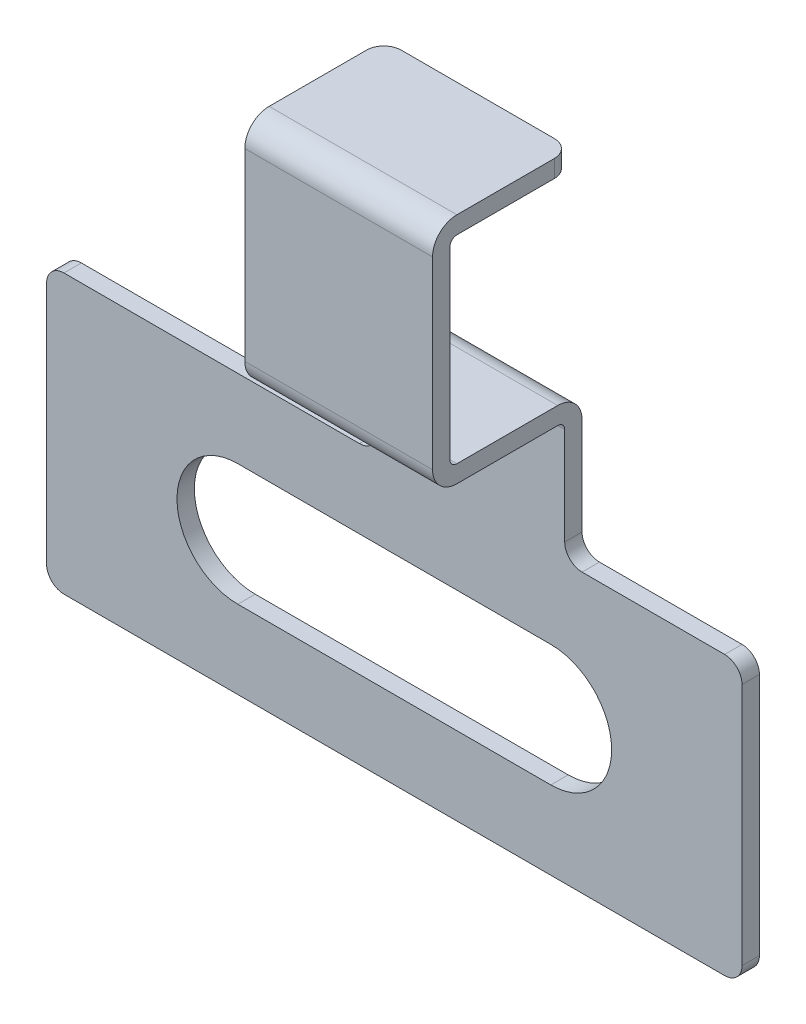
ISO-10303-21;
HEADER;
FILE_DESCRIPTION(('STEP AP214'),'2;1');
FILE_NAME('part.step','',(''),(''),'','','');
FILE_SCHEMA(('AUTOMOTIVE_DESIGN { 1 0 10303 214 1 1 1 1 }'));
ENDSEC;
DATA;
#1=APPLICATION_CONTEXT('core data for automotive mechanical design processes');
#2=APPLICATION_PROTOCOL_DEFINITION('international standard','automotive_design',2000,#1);
#3=PRODUCT_CONTEXT('',#1,'mechanical');
#4=PRODUCT('Part','Part','',(#3));
#5=PRODUCT_RELATED_PRODUCT_CATEGORY('part','',(#4));
#6=PRODUCT_DEFINITION_FORMATION('','',#4);
#7=PRODUCT_DEFINITION_CONTEXT('part definition',#1,'design');
#8=PRODUCT_DEFINITION('design','',#6,#7);
#9=PRODUCT_DEFINITION_SHAPE('','',#8);
#10=(LENGTH_UNIT() NAMED_UNIT(*) SI_UNIT(.MILLI.,.METRE.));
#11=(NAMED_UNIT(*) PLANE_ANGLE_UNIT() SI_UNIT($,.RADIAN.));
#12=(NAMED_UNIT(*) SI_UNIT($,.STERADIAN.) SOLID_ANGLE_UNIT());
#13=UNCERTAINTY_MEASURE_WITH_UNIT(LENGTH_MEASURE(1.E-05),#10,'distance_accuracy_value','');
#14=(GEOMETRIC_REPRESENTATION_CONTEXT(3) GLOBAL_UNCERTAINTY_ASSIGNED_CONTEXT((#13)) GLOBAL_UNIT_ASSIGNED_CONTEXT((#10,
#11,#12)) REPRESENTATION_CONTEXT('',''));
#15=CARTESIAN_POINT('',(0.,0.,0.));
#16=DIRECTION('',(0.,0.,1.));
#17=DIRECTION('',(1.,0.,0.));
#18=AXIS2_PLACEMENT_3D('',#15,#16,#17);
#19=CARTESIAN_POINT('',(-5.5,13.7,3.6));
#20=DIRECTION('',(0.,-1.,0.));
#21=DIRECTION('',(-1.,0.,0.));
#22=AXIS2_PLACEMENT_3D('',#19,#20,#21);
#23=PLANE('',#22);
#24=DIRECTION('',(1.,0.,0.));
#25=VECTOR('',#24,1.);
#26=CARTESIAN_POINT('',(-5.5,13.7,0.3));
#27=LINE('',#26,#25);
#28=CARTESIAN_POINT('',(4.5,13.7,0.3));
#29=VERTEX_POINT('',#28);
#30=CARTESIAN_POINT('',(8.9,13.7,0.3));
#31=VERTEX_POINT('',#30);
#32=EDGE_CURVE('E393',#29,#31,#27,.T.);
#33=ORIENTED_EDGE('',*,*,#32,.T.);
#34=CARTESIAN_POINT('',(8.9,13.7,0.8));
#35=DIRECTION('',(0.,-1.,0.));
#36=DIRECTION('',(-1.,0.,0.));
#37=AXIS2_PLACEMENT_3D('',#34,#35,#36);
#38=CIRCLE('',#37,0.5);
#39=CARTESIAN_POINT('',(9.4,13.7,0.8));
#40=VERTEX_POINT('',#39);
#41=EDGE_CURVE('E518',#31,#40,#38,.T.);
#42=ORIENTED_EDGE('',*,*,#41,.T.);
#43=DIRECTION('',(0.,0.,-1.));
#44=VECTOR('',#43,1.);
#45=CARTESIAN_POINT('',(9.4,13.7,3.6));
#46=LINE('',#45,#44);
#47=CARTESIAN_POINT('',(9.4,13.7,3.6));
#48=VERTEX_POINT('',#47);
#49=EDGE_CURVE('E289',#48,#40,#46,.T.);
#50=ORIENTED_EDGE('',*,*,#49,.F.);
#51=DIRECTION('',(1.,0.,0.));
#52=VECTOR('',#51,1.);
#53=CARTESIAN_POINT('',(-5.5,13.7,3.6));
#54=LINE('',#53,#52);
#55=CARTESIAN_POINT('',(4.,13.7,3.6));
#56=VERTEX_POINT('',#55);
#57=EDGE_CURVE('E400',#56,#48,#54,.T.);
#58=ORIENTED_EDGE('',*,*,#57,.F.);
#59=DIRECTION('',(0.,0.,1.));
#60=VECTOR('',#59,1.);
#61=CARTESIAN_POINT('',(4.,13.7,3.6));
#62=LINE('',#61,#60);
#63=CARTESIAN_POINT('',(4.,13.7,0.8));
#64=VERTEX_POINT('',#63);
#65=EDGE_CURVE('E344',#64,#56,#62,.T.);
#66=ORIENTED_EDGE('',*,*,#65,.F.);
#67=CARTESIAN_POINT('',(4.5,13.7,0.8));
#68=DIRECTION('',(0.,-1.,0.));
#69=DIRECTION('',(-1.,0.,0.));
#70=AXIS2_PLACEMENT_3D('',#67,#68,#69);
#71=CIRCLE('',#70,0.5);
#72=EDGE_CURVE('E515',#64,#29,#71,.T.);
#73=ORIENTED_EDGE('',*,*,#72,.T.);
#74=EDGE_LOOP('',(#33,#42,#50,#58,#66,#73));
#75=FACE_BOUND('',#74,.T.);
#76=ADVANCED_FACE('F15',(#75),#23,.T.);
#77=CARTESIAN_POINT('',(-5.5,13.5,3.6));
#78=DIRECTION('',(1.,0.,0.));
#79=DIRECTION('',(0.,0.,-1.));
#80=AXIS2_PLACEMENT_3D('',#77,#78,#79);
#81=CYLINDRICAL_SURFACE('',#80,0.2);
#82=CARTESIAN_POINT('',(9.4,13.5,3.6));
#83=DIRECTION('',(-1.,0.,0.));
#84=DIRECTION('',(0.,1.,0.));
#85=AXIS2_PLACEMENT_3D('',#82,#83,#84);
#86=CIRCLE('',#85,0.2);
#87=CARTESIAN_POINT('',(9.4,13.5,3.8));
#88=VERTEX_POINT('',#87);
#89=EDGE_CURVE('E293',#88,#48,#86,.T.);
#90=ORIENTED_EDGE('',*,*,#89,.F.);
#91=DIRECTION('',(1.,0.,0.));
#92=VECTOR('',#91,1.);
#93=CARTESIAN_POINT('',(-5.5,13.5,3.8));
#94=LINE('',#93,#92);
#95=CARTESIAN_POINT('',(4.,13.5,3.8));
#96=VERTEX_POINT('',#95);
#97=EDGE_CURVE('E405',#96,#88,#94,.T.);
#98=ORIENTED_EDGE('',*,*,#97,.F.);
#99=CARTESIAN_POINT('',(4.,13.5,3.6));
#100=DIRECTION('',(1.,0.,0.));
#101=DIRECTION('',(0.,-1.,0.));
#102=AXIS2_PLACEMENT_3D('',#99,#100,#101);
#103=CIRCLE('',#102,0.2);
#104=EDGE_CURVE('E347',#56,#96,#103,.T.);
#105=ORIENTED_EDGE('',*,*,#104,.F.);
#106=ORIENTED_EDGE('',*,*,#57,.T.);
#107=EDGE_LOOP('',(#90,#98,#105,#106));
#108=FACE_BOUND('',#107,.T.);
#109=ADVANCED_FACE('F638',(#108),#81,.F.);
#110=CARTESIAN_POINT('',(-5.5,8.2,3.8));
#111=DIRECTION('',(0.,0.,-1.));
#112=DIRECTION('',(-1.,0.,0.));
#113=AXIS2_PLACEMENT_3D('',#110,#111,#112);
#114=PLANE('',#113);
#115=DIRECTION('',(0.,1.,0.));
#116=VECTOR('',#115,1.);
#117=CARTESIAN_POINT('',(9.4,8.2,3.8));
#118=LINE('',#117,#116);
#119=CARTESIAN_POINT('',(9.4,8.2,3.8));
#120=VERTEX_POINT('',#119);
#121=EDGE_CURVE('E296',#120,#88,#118,.T.);
#122=ORIENTED_EDGE('',*,*,#121,.F.);
#123=DIRECTION('',(1.,0.,0.));
#124=VECTOR('',#123,1.);
#125=CARTESIAN_POINT('',(-5.5,8.2,3.8));
#126=LINE('',#125,#124);
#127=CARTESIAN_POINT('',(4.,8.2,3.8));
#128=VERTEX_POINT('',#127);
#129=EDGE_CURVE('E409',#128,#120,#126,.T.);
#130=ORIENTED_EDGE('',*,*,#129,.F.);
#131=DIRECTION('',(0.,-1.,0.));
#132=VECTOR('',#131,1.);
#133=CARTESIAN_POINT('',(4.,8.2,3.8));
#134=LINE('',#133,#132);
#135=EDGE_CURVE('E350',#96,#128,#134,.T.);
#136=ORIENTED_EDGE('',*,*,#135,.F.);
#137=ORIENTED_EDGE('',*,*,#97,.T.);
#138=EDGE_LOOP('',(#122,#130,#136,#137));
#139=FACE_BOUND('',#138,.T.);
#140=ADVANCED_FACE('F645',(#139),#114,.T.);
#141=CARTESIAN_POINT('',(-5.5,8.2,3.6));
#142=DIRECTION('',(1.,0.,0.));
#143=DIRECTION('',(0.,0.,-1.));
#144=AXIS2_PLACEMENT_3D('',#141,#142,#143);
#145=CYLINDRICAL_SURFACE('',#144,0.2);
#146=CARTESIAN_POINT('',(9.4,8.2,3.6));
#147=DIRECTION('',(-1.,0.,0.));
#148=DIRECTION('',(0.,1.,0.));
#149=AXIS2_PLACEMENT_3D('',#146,#147,#148);
#150=CIRCLE('',#149,0.2);
#151=CARTESIAN_POINT('',(9.4,8.,3.6));
#152=VERTEX_POINT('',#151);
#153=EDGE_CURVE('E299',#152,#120,#150,.T.);
#154=ORIENTED_EDGE('',*,*,#153,.F.);
#155=DIRECTION('',(1.,0.,0.));
#156=VECTOR('',#155,1.);
#157=CARTESIAN_POINT('',(-5.5,8.,3.6));
#158=LINE('',#157,#156);
#159=CARTESIAN_POINT('',(4.,8.,3.6));
#160=VERTEX_POINT('',#159);
#161=EDGE_CURVE('E413',#160,#152,#158,.T.);
#162=ORIENTED_EDGE('',*,*,#161,.F.);
#163=CARTESIAN_POINT('',(4.,8.2,3.6));
#164=DIRECTION('',(1.,0.,0.));
#165=DIRECTION('',(0.,-1.,0.));
#166=AXIS2_PLACEMENT_3D('',#163,#164,#165);
#167=CIRCLE('',#166,0.2);
#168=EDGE_CURVE('E353',#128,#160,#167,.T.);
#169=ORIENTED_EDGE('',*,*,#168,.F.);
#170=ORIENTED_EDGE('',*,*,#129,.T.);
#171=EDGE_LOOP('',(#154,#162,#169,#170));
#172=FACE_BOUND('',#171,.T.);
#173=ADVANCED_FACE('F854',(#172),#145,.F.);
#174=CARTESIAN_POINT('',(-5.5,8.,0.7));
#175=DIRECTION('',(0.,1.,0.));
#176=DIRECTION('',(0.,0.,1.));
#177=AXIS2_PLACEMENT_3D('',#174,#175,#176);
#178=PLANE('',#177);
#179=DIRECTION('',(0.,0.,1.));
#180=VECTOR('',#179,1.);
#181=CARTESIAN_POINT('',(9.4,8.,0.7));
#182=LINE('',#181,#180);
#183=CARTESIAN_POINT('',(9.4,8.,0.7));
#184=VERTEX_POINT('',#183);
#185=EDGE_CURVE('E302',#184,#152,#182,.T.);
#186=ORIENTED_EDGE('',*,*,#185,.F.);
#187=DIRECTION('',(1.,0.,0.));
#188=VECTOR('',#187,1.);
#189=CARTESIAN_POINT('',(-5.5,8.,0.7));
#190=LINE('',#189,#188);
#191=CARTESIAN_POINT('',(4.,8.,0.7));
#192=VERTEX_POINT('',#191);
#193=EDGE_CURVE('E417',#192,#184,#190,.T.);
#194=ORIENTED_EDGE('',*,*,#193,.F.);
#195=DIRECTION('',(0.,0.,-1.));
#196=VECTOR('',#195,1.);
#197=CARTESIAN_POINT('',(4.,8.,0.7));
#198=LINE('',#197,#196);
#199=EDGE_CURVE('E356',#160,#192,#198,.T.);
#200=ORIENTED_EDGE('',*,*,#199,.F.);
#201=ORIENTED_EDGE('',*,*,#161,.T.);
#202=EDGE_LOOP('',(#186,#194,#200,#201));
#203=FACE_BOUND('',#202,.T.);
#204=ADVANCED_FACE('F846',(#203),#178,.T.);
#205=CARTESIAN_POINT('',(-5.5,7.3,0.7));
#206=DIRECTION('',(1.,0.,0.));
#207=DIRECTION('',(0.,0.,-1.));
#208=AXIS2_PLACEMENT_3D('',#205,#206,#207);
#209=CYLINDRICAL_SURFACE('',#208,0.7);
#210=CARTESIAN_POINT('',(9.4,7.3,0.7));
#211=DIRECTION('',(-1.,0.,0.));
#212=DIRECTION('',(0.,1.,0.));
#213=AXIS2_PLACEMENT_3D('',#210,#211,#212);
#214=CIRCLE('',#213,0.7);
#215=CARTESIAN_POINT('',(9.4,7.3,0.));
#216=VERTEX_POINT('',#215);
#217=EDGE_CURVE('E305',#216,#184,#214,.F.);
#218=ORIENTED_EDGE('',*,*,#217,.F.);
#219=DIRECTION('',(1.,0.,0.));
#220=VECTOR('',#219,1.);
#221=CARTESIAN_POINT('',(-5.5,7.3,0.));
#222=LINE('',#221,#220);
#223=CARTESIAN_POINT('',(4.,7.3,0.));
#224=VERTEX_POINT('',#223);
#225=EDGE_CURVE('E421',#224,#216,#222,.T.);
#226=ORIENTED_EDGE('',*,*,#225,.F.);
#227=CARTESIAN_POINT('',(4.,7.3,0.7));
#228=DIRECTION('',(1.,0.,0.));
#229=DIRECTION('',(0.,-1.,0.));
#230=AXIS2_PLACEMENT_3D('',#227,#228,#229);
#231=CIRCLE('',#230,0.7);
#232=EDGE_CURVE('E359',#192,#224,#231,.F.);
#233=ORIENTED_EDGE('',*,*,#232,.F.);
#234=ORIENTED_EDGE('',*,*,#193,.T.);
#235=EDGE_LOOP('',(#218,#226,#233,#234));
#236=FACE_BOUND('',#235,.T.);
#237=ADVANCED_FACE('F583',(#236),#209,.T.);
#238=CARTESIAN_POINT('',(-5.5,7.3,0.));
#239=DIRECTION('',(0.,0.,-1.));
#240=DIRECTION('',(0.,1.,0.));
#241=AXIS2_PLACEMENT_3D('',#238,#239,#240);
#242=PLANE('',#241);
#243=CARTESIAN_POINT('',(0.,0.,0.));
#244=DIRECTION('',(0.,0.,-1.));
#245=DIRECTION('',(0.,1.,0.));
#246=AXIS2_PLACEMENT_3D('',#243,#244,#245);
#247=CIRCLE('',#246,1.75);
#248=CARTESIAN_POINT('',(0.,-1.75,0.));
#249=VERTEX_POINT('',#248);
#250=CARTESIAN_POINT('',(0.,1.75,0.));
#251=VERTEX_POINT('',#250);
#252=EDGE_CURVE('E268',#249,#251,#247,.T.);
#253=ORIENTED_EDGE('',*,*,#252,.F.);
#254=DIRECTION('',(-1.,0.,0.));
#255=VECTOR('',#254,1.);
#256=CARTESIAN_POINT('',(-5.5,-1.75,0.));
#257=LINE('',#256,#255);
#258=CARTESIAN_POINT('',(9.,-1.75,0.));
#259=VERTEX_POINT('',#258);
#260=EDGE_CURVE('E256',#259,#249,#257,.T.);
#261=ORIENTED_EDGE('',*,*,#260,.F.);
#262=CARTESIAN_POINT('',(9.,0.,0.));
#263=DIRECTION('',(0.,0.,-1.));
#264=DIRECTION('',(0.,1.,0.));
#265=AXIS2_PLACEMENT_3D('',#262,#263,#264);
#266=CIRCLE('',#265,1.75);
#267=CARTESIAN_POINT('',(9.,1.75,0.));
#268=VERTEX_POINT('',#267);
#269=EDGE_CURVE('E230',#268,#259,#266,.T.);
#270=ORIENTED_EDGE('',*,*,#269,.F.);
#271=DIRECTION('',(1.,0.,0.));
#272=VECTOR('',#271,1.);
#273=CARTESIAN_POINT('',(-5.5,1.75,0.));
#274=LINE('',#273,#272);
#275=EDGE_CURVE('E265',#251,#268,#274,.T.);
#276=ORIENTED_EDGE('',*,*,#275,.F.);
#277=EDGE_LOOP('',(#253,#261,#270,#276));
#278=FACE_BOUND('',#277,.T.);
#279=DIRECTION('',(1.,0.,0.));
#280=VECTOR('',#279,1.);
#281=CARTESIAN_POINT('',(14.5,4.,0.));
#282=LINE('',#281,#280);
#283=CARTESIAN_POINT('',(9.9,4.,0.));
#284=VERTEX_POINT('',#283);
#285=CARTESIAN_POINT('',(14.,4.,0.));
#286=VERTEX_POINT('',#285);
#287=EDGE_CURVE('E276',#284,#286,#282,.T.);
#288=ORIENTED_EDGE('',*,*,#287,.T.);
#289=CARTESIAN_POINT('',(14.,3.5,0.));
#290=DIRECTION('',(0.,0.,-1.));
#291=DIRECTION('',(0.,1.,0.));
#292=AXIS2_PLACEMENT_3D('',#289,#290,#291);
#293=CIRCLE('',#292,0.5);
#294=CARTESIAN_POINT('',(14.5,3.5,0.));
#295=VERTEX_POINT('',#294);
#296=EDGE_CURVE('E498',#286,#295,#293,.T.);
#297=ORIENTED_EDGE('',*,*,#296,.T.);
#298=DIRECTION('',(0.,1.,0.));
#299=VECTOR('',#298,1.);
#300=CARTESIAN_POINT('',(14.5,7.3,0.));
#301=LINE('',#300,#299);
#302=CARTESIAN_POINT('',(14.5,-3.5,0.));
#303=VERTEX_POINT('',#302);
#304=EDGE_CURVE('E389',#303,#295,#301,.T.);
#305=ORIENTED_EDGE('',*,*,#304,.F.);
#306=CARTESIAN_POINT('',(14.,-3.5,0.));
#307=DIRECTION('',(0.,0.,-1.));
#308=DIRECTION('',(0.,1.,0.));
#309=AXIS2_PLACEMENT_3D('',#306,#307,#308);
#310=CIRCLE('',#309,0.5);
#311=CARTESIAN_POINT('',(14.,-4.,0.));
#312=VERTEX_POINT('',#311);
#313=EDGE_CURVE('E495',#303,#312,#310,.T.);
#314=ORIENTED_EDGE('',*,*,#313,.T.);
#315=DIRECTION('',(1.,0.,0.));
#316=VECTOR('',#315,1.);
#317=CARTESIAN_POINT('',(-5.5,-4.,0.));
#318=LINE('',#317,#316);
#319=CARTESIAN_POINT('',(-5.,-4.,0.));
#320=VERTEX_POINT('',#319);
#321=EDGE_CURVE('E425',#320,#312,#318,.T.);
#322=ORIENTED_EDGE('',*,*,#321,.F.);
#323=CARTESIAN_POINT('',(-5.,-3.5,0.));
#324=DIRECTION('',(0.,0.,-1.));
#325=DIRECTION('',(0.,1.,0.));
#326=AXIS2_PLACEMENT_3D('',#323,#324,#325);
#327=CIRCLE('',#326,0.5);
#328=CARTESIAN_POINT('',(-5.5,-3.5,0.));
#329=VERTEX_POINT('',#328);
#330=EDGE_CURVE('E492',#320,#329,#327,.T.);
#331=ORIENTED_EDGE('',*,*,#330,.T.);
#332=DIRECTION('',(0.,1.,0.));
#333=VECTOR('',#332,1.);
#334=CARTESIAN_POINT('',(-5.5,7.3,0.));
#335=LINE('',#334,#333);
#336=CARTESIAN_POINT('',(-5.5,3.5,0.));
#337=VERTEX_POINT('',#336);
#338=EDGE_CURVE('E388',#329,#337,#335,.T.);
#339=ORIENTED_EDGE('',*,*,#338,.T.);
#340=CARTESIAN_POINT('',(-5.,3.5,0.));
#341=DIRECTION('',(0.,0.,-1.));
#342=DIRECTION('',(0.,1.,0.));
#343=AXIS2_PLACEMENT_3D('',#340,#341,#342);
#344=CIRCLE('',#343,0.5);
#345=CARTESIAN_POINT('',(-5.,4.,0.));
#346=VERTEX_POINT('',#345);
#347=EDGE_CURVE('E489',#337,#346,#344,.T.);
#348=ORIENTED_EDGE('',*,*,#347,.T.);
#349=DIRECTION('',(1.,0.,0.));
#350=VECTOR('',#349,1.);
#351=CARTESIAN_POINT('',(-5.5,4.,0.));
#352=LINE('',#351,#350);
#353=CARTESIAN_POINT('',(3.5,4.,0.));
#354=VERTEX_POINT('',#353);
#355=EDGE_CURVE('E328',#346,#354,#352,.T.);
#356=ORIENTED_EDGE('',*,*,#355,.T.);
#357=CARTESIAN_POINT('',(3.5,4.5,0.));
#358=DIRECTION('',(0.,0.,-1.));
#359=DIRECTION('',(0.,1.,0.));
#360=AXIS2_PLACEMENT_3D('',#357,#358,#359);
#361=CIRCLE('',#360,0.5);
#362=CARTESIAN_POINT('',(4.,4.5,0.));
#363=VERTEX_POINT('',#362);
#364=EDGE_CURVE('E9',#354,#363,#361,.F.);
#365=ORIENTED_EDGE('',*,*,#364,.T.);
#366=DIRECTION('',(0.,1.,0.));
#367=VECTOR('',#366,1.);
#368=CARTESIAN_POINT('',(4.,14.2,0.));
#369=LINE('',#368,#367);
#370=EDGE_CURVE('E332',#363,#224,#369,.T.);
#371=ORIENTED_EDGE('',*,*,#370,.T.);
#372=ORIENTED_EDGE('',*,*,#225,.T.);
#373=DIRECTION('',(0.,-1.,0.));
#374=VECTOR('',#373,1.);
#375=CARTESIAN_POINT('',(9.4,14.2,0.));
#376=LINE('',#375,#374);
#377=CARTESIAN_POINT('',(9.4,4.5,0.));
#378=VERTEX_POINT('',#377);
#379=EDGE_CURVE('E272',#216,#378,#376,.T.);
#380=ORIENTED_EDGE('',*,*,#379,.T.);
#381=CARTESIAN_POINT('',(9.9,4.5,0.));
#382=DIRECTION('',(0.,0.,-1.));
#383=DIRECTION('',(0.,1.,0.));
#384=AXIS2_PLACEMENT_3D('',#381,#382,#383);
#385=CIRCLE('',#384,0.5);
#386=EDGE_CURVE('E558',#378,#284,#385,.F.);
#387=ORIENTED_EDGE('',*,*,#386,.T.);
#388=EDGE_LOOP('',(#288,#297,#305,#314,#322,#331,#339,#348,#356,#365,#371,#372,#380,#387));
#389=FACE_BOUND('',#388,.T.);
#390=ADVANCED_FACE('F573',(#278,#389),#242,.T.);
#391=CARTESIAN_POINT('',(-5.5,-4.,0.));
#392=DIRECTION('',(0.,1.,0.));
#393=DIRECTION('',(1.,0.,0.));
#394=AXIS2_PLACEMENT_3D('',#391,#392,#393);
#395=PLANE('',#394);
#396=ORIENTED_EDGE('',*,*,#321,.T.);
#397=DIRECTION('',(0.,0.,1.));
#398=VECTOR('',#397,1.);
#399=CARTESIAN_POINT('',(14.,-4.,0.5));
#400=LINE('',#399,#398);
#401=CARTESIAN_POINT('',(14.,-4.,0.5));
#402=VERTEX_POINT('',#401);
#403=EDGE_CURVE('E530',#312,#402,#400,.T.);
#404=ORIENTED_EDGE('',*,*,#403,.T.);
#405=DIRECTION('',(1.,0.,0.));
#406=VECTOR('',#405,1.);
#407=CARTESIAN_POINT('',(-5.5,-4.,0.5));
#408=LINE('',#407,#406);
#409=CARTESIAN_POINT('',(-5.,-4.,0.5));
#410=VERTEX_POINT('',#409);
#411=EDGE_CURVE('E429',#410,#402,#408,.T.);
#412=ORIENTED_EDGE('',*,*,#411,.F.);
#413=DIRECTION('',(0.,0.,1.));
#414=VECTOR('',#413,1.);
#415=CARTESIAN_POINT('',(-5.,-4.,0.));
#416=LINE('',#415,#414);
#417=EDGE_CURVE('E527',#410,#320,#416,.F.);
#418=ORIENTED_EDGE('',*,*,#417,.T.);
#419=EDGE_LOOP('',(#396,#404,#412,#418));
#420=FACE_BOUND('',#419,.T.);
#421=ADVANCED_FACE('F612',(#420),#395,.F.);
#422=CARTESIAN_POINT('',(-5.5,7.3,0.5));
#423=DIRECTION('',(0.,0.,-1.));
#424=DIRECTION('',(0.,1.,0.));
#425=AXIS2_PLACEMENT_3D('',#422,#423,#424);
#426=PLANE('',#425);
#427=DIRECTION('',(1.,0.,0.));
#428=VECTOR('',#427,1.);
#429=CARTESIAN_POINT('',(0.,-1.75,0.5));
#430=LINE('',#429,#428);
#431=CARTESIAN_POINT('',(0.,-1.75,0.5));
#432=VERTEX_POINT('',#431);
#433=CARTESIAN_POINT('',(9.,-1.75,0.5));
#434=VERTEX_POINT('',#433);
#435=EDGE_CURVE('E237',#432,#434,#430,.T.);
#436=ORIENTED_EDGE('',*,*,#435,.F.);
#437=CARTESIAN_POINT('',(0.,0.,0.5));
#438=DIRECTION('',(0.,0.,1.));
#439=DIRECTION('',(0.,1.,0.));
#440=AXIS2_PLACEMENT_3D('',#437,#438,#439);
#441=CIRCLE('',#440,1.75);
#442=CARTESIAN_POINT('',(0.,1.75,0.5));
#443=VERTEX_POINT('',#442);
#444=EDGE_CURVE('E39',#443,#432,#441,.T.);
#445=ORIENTED_EDGE('',*,*,#444,.F.);
#446=DIRECTION('',(-1.,0.,0.));
#447=VECTOR('',#446,1.);
#448=CARTESIAN_POINT('',(0.,1.75,0.5));
#449=LINE('',#448,#447);
#450=CARTESIAN_POINT('',(9.,1.75,0.5));
#451=VERTEX_POINT('',#450);
#452=EDGE_CURVE('E245',#451,#443,#449,.T.);
#453=ORIENTED_EDGE('',*,*,#452,.F.);
#454=CARTESIAN_POINT('',(9.,0.,0.5));
#455=DIRECTION('',(0.,0.,1.));
#456=DIRECTION('',(0.,1.,0.));
#457=AXIS2_PLACEMENT_3D('',#454,#455,#456);
#458=CIRCLE('',#457,1.75);
#459=EDGE_CURVE('E227',#434,#451,#458,.T.);
#460=ORIENTED_EDGE('',*,*,#459,.F.);
#461=EDGE_LOOP('',(#436,#445,#453,#460));
#462=FACE_BOUND('',#461,.T.);
#463=DIRECTION('',(0.,1.,0.));
#464=VECTOR('',#463,1.);
#465=CARTESIAN_POINT('',(14.5,7.3,0.5));
#466=LINE('',#465,#464);
#467=CARTESIAN_POINT('',(14.5,-3.5,0.5));
#468=VERTEX_POINT('',#467);
#469=CARTESIAN_POINT('',(14.5,3.5,0.5));
#470=VERTEX_POINT('',#469);
#471=EDGE_CURVE('E383',#468,#470,#466,.T.);
#472=ORIENTED_EDGE('',*,*,#471,.T.);
#473=CARTESIAN_POINT('',(14.,3.5,0.5));
#474=DIRECTION('',(0.,0.,-1.));
#475=DIRECTION('',(0.,1.,0.));
#476=AXIS2_PLACEMENT_3D('',#473,#474,#475);
#477=CIRCLE('',#476,0.5);
#478=CARTESIAN_POINT('',(14.,4.,0.5));
#479=VERTEX_POINT('',#478);
#480=EDGE_CURVE('E479',#470,#479,#477,.F.);
#481=ORIENTED_EDGE('',*,*,#480,.T.);
#482=DIRECTION('',(-1.,0.,0.));
#483=VECTOR('',#482,1.);
#484=CARTESIAN_POINT('',(-5.5,4.,0.5));
#485=LINE('',#484,#483);
#486=CARTESIAN_POINT('',(9.9,4.,0.5));
#487=VERTEX_POINT('',#486);
#488=EDGE_CURVE('E285',#479,#487,#485,.T.);
#489=ORIENTED_EDGE('',*,*,#488,.T.);
#490=CARTESIAN_POINT('',(9.9,4.5,0.5));
#491=DIRECTION('',(0.,0.,-1.));
#492=DIRECTION('',(0.,1.,0.));
#493=AXIS2_PLACEMENT_3D('',#490,#491,#492);
#494=CIRCLE('',#493,0.5);
#495=CARTESIAN_POINT('',(9.4,4.5,0.5));
#496=VERTEX_POINT('',#495);
#497=EDGE_CURVE('E555',#487,#496,#494,.T.);
#498=ORIENTED_EDGE('',*,*,#497,.T.);
#499=DIRECTION('',(0.,1.,0.));
#500=VECTOR('',#499,1.);
#501=CARTESIAN_POINT('',(9.4,7.3,0.5));
#502=LINE('',#501,#500);
#503=CARTESIAN_POINT('',(9.4,7.3,0.5));
#504=VERTEX_POINT('',#503);
#505=EDGE_CURVE('E324',#496,#504,#502,.T.);
#506=ORIENTED_EDGE('',*,*,#505,.T.);
#507=DIRECTION('',(1.,0.,0.));
#508=VECTOR('',#507,1.);
#509=CARTESIAN_POINT('',(-5.5,7.3,0.5));
#510=LINE('',#509,#508);
#511=CARTESIAN_POINT('',(4.,7.3,0.5));
#512=VERTEX_POINT('',#511);
#513=EDGE_CURVE('E433',#512,#504,#510,.T.);
#514=ORIENTED_EDGE('',*,*,#513,.F.);
#515=DIRECTION('',(0.,-1.,0.));
#516=VECTOR('',#515,1.);
#517=CARTESIAN_POINT('',(4.,7.3,0.5));
#518=LINE('',#517,#516);
#519=CARTESIAN_POINT('',(4.,4.5,0.5));
#520=VERTEX_POINT('',#519);
#521=EDGE_CURVE('E379',#512,#520,#518,.T.);
#522=ORIENTED_EDGE('',*,*,#521,.T.);
#523=CARTESIAN_POINT('',(3.5,4.5,0.5));
#524=DIRECTION('',(0.,0.,-1.));
#525=DIRECTION('',(0.,1.,0.));
#526=AXIS2_PLACEMENT_3D('',#523,#524,#525);
#527=CIRCLE('',#526,0.5);
#528=CARTESIAN_POINT('',(3.5,4.,0.5));
#529=VERTEX_POINT('',#528);
#530=EDGE_CURVE('E24',#520,#529,#527,.T.);
#531=ORIENTED_EDGE('',*,*,#530,.T.);
#532=DIRECTION('',(-1.,0.,0.));
#533=VECTOR('',#532,1.);
#534=CARTESIAN_POINT('',(-5.5,4.,0.5));
#535=LINE('',#534,#533);
#536=CARTESIAN_POINT('',(-5.,4.,0.5));
#537=VERTEX_POINT('',#536);
#538=EDGE_CURVE('E340',#529,#537,#535,.T.);
#539=ORIENTED_EDGE('',*,*,#538,.T.);
#540=CARTESIAN_POINT('',(-5.,3.5,0.5));
#541=DIRECTION('',(0.,0.,-1.));
#542=DIRECTION('',(0.,1.,0.));
#543=AXIS2_PLACEMENT_3D('',#540,#541,#542);
#544=CIRCLE('',#543,0.5);
#545=CARTESIAN_POINT('',(-5.5,3.5,0.5));
#546=VERTEX_POINT('',#545);
#547=EDGE_CURVE('E470',#537,#546,#544,.F.);
#548=ORIENTED_EDGE('',*,*,#547,.T.);
#549=DIRECTION('',(0.,1.,0.));
#550=VECTOR('',#549,1.);
#551=CARTESIAN_POINT('',(-5.5,7.3,0.5));
#552=LINE('',#551,#550);
#553=CARTESIAN_POINT('',(-5.5,-3.5,0.5));
#554=VERTEX_POINT('',#553);
#555=EDGE_CURVE('E384',#554,#546,#552,.T.);
#556=ORIENTED_EDGE('',*,*,#555,.F.);
#557=CARTESIAN_POINT('',(-5.,-3.5,0.5));
#558=DIRECTION('',(0.,0.,-1.));
#559=DIRECTION('',(0.,1.,0.));
#560=AXIS2_PLACEMENT_3D('',#557,#558,#559);
#561=CIRCLE('',#560,0.5);
#562=EDGE_CURVE('E473',#554,#410,#561,.F.);
#563=ORIENTED_EDGE('',*,*,#562,.T.);
#564=ORIENTED_EDGE('',*,*,#411,.T.);
#565=CARTESIAN_POINT('',(14.,-3.5,0.5));
#566=DIRECTION('',(0.,0.,-1.));
#567=DIRECTION('',(0.,1.,0.));
#568=AXIS2_PLACEMENT_3D('',#565,#566,#567);
#569=CIRCLE('',#568,0.5);
#570=EDGE_CURVE('E476',#402,#468,#569,.F.);
#571=ORIENTED_EDGE('',*,*,#570,.T.);
#572=EDGE_LOOP('',(#472,#481,#489,#498,#506,#514,#522,#531,#539,#548,#556,#563,#564,#571));
#573=FACE_BOUND('',#572,.T.);
#574=ADVANCED_FACE('F242',(#462,#573),#426,.F.);
#575=CARTESIAN_POINT('',(-5.5,7.3,0.7));
#576=DIRECTION('',(1.,0.,0.));
#577=DIRECTION('',(0.,0.,-1.));
#578=AXIS2_PLACEMENT_3D('',#575,#576,#577);
#579=CYLINDRICAL_SURFACE('',#578,0.2);
#580=ORIENTED_EDGE('',*,*,#513,.T.);
#581=CARTESIAN_POINT('',(9.4,7.3,0.7));
#582=DIRECTION('',(-1.,0.,0.));
#583=DIRECTION('',(0.,1.,0.));
#584=AXIS2_PLACEMENT_3D('',#581,#582,#583);
#585=CIRCLE('',#584,0.2);
#586=CARTESIAN_POINT('',(9.4,7.5,0.7));
#587=VERTEX_POINT('',#586);
#588=EDGE_CURVE('E320',#504,#587,#585,.F.);
#589=ORIENTED_EDGE('',*,*,#588,.T.);
#590=DIRECTION('',(1.,0.,0.));
#591=VECTOR('',#590,1.);
#592=CARTESIAN_POINT('',(-5.5,7.5,0.7));
#593=LINE('',#592,#591);
#594=CARTESIAN_POINT('',(4.,7.5,0.7));
#595=VERTEX_POINT('',#594);
#596=EDGE_CURVE('E437',#595,#587,#593,.T.);
#597=ORIENTED_EDGE('',*,*,#596,.F.);
#598=CARTESIAN_POINT('',(4.,7.3,0.7));
#599=DIRECTION('',(1.,0.,0.));
#600=DIRECTION('',(0.,-1.,0.));
#601=AXIS2_PLACEMENT_3D('',#598,#599,#600);
#602=CIRCLE('',#601,0.2);
#603=EDGE_CURVE('E375',#595,#512,#602,.F.);
#604=ORIENTED_EDGE('',*,*,#603,.T.);
#605=EDGE_LOOP('',(#580,#589,#597,#604));
#606=FACE_BOUND('',#605,.T.);
#607=ADVANCED_FACE('F807',(#606),#579,.F.);
#608=CARTESIAN_POINT('',(-5.5,7.5,0.7));
#609=DIRECTION('',(0.,1.,0.));
#610=DIRECTION('',(0.,0.,1.));
#611=AXIS2_PLACEMENT_3D('',#608,#609,#610);
#612=PLANE('',#611);
#613=ORIENTED_EDGE('',*,*,#596,.T.);
#614=DIRECTION('',(0.,0.,1.));
#615=VECTOR('',#614,1.);
#616=CARTESIAN_POINT('',(9.4,7.5,0.7));
#617=LINE('',#616,#615);
#618=CARTESIAN_POINT('',(9.4,7.5,3.6));
#619=VERTEX_POINT('',#618);
#620=EDGE_CURVE('E316',#587,#619,#617,.T.);
#621=ORIENTED_EDGE('',*,*,#620,.T.);
#622=DIRECTION('',(1.,0.,0.));
#623=VECTOR('',#622,1.);
#624=CARTESIAN_POINT('',(-5.5,7.5,3.6));
#625=LINE('',#624,#623);
#626=CARTESIAN_POINT('',(4.,7.5,3.6));
#627=VERTEX_POINT('',#626);
#628=EDGE_CURVE('E441',#627,#619,#625,.T.);
#629=ORIENTED_EDGE('',*,*,#628,.F.);
#630=DIRECTION('',(0.,0.,-1.));
#631=VECTOR('',#630,1.);
#632=CARTESIAN_POINT('',(4.,7.5,0.7));
#633=LINE('',#632,#631);
#634=EDGE_CURVE('E371',#627,#595,#633,.T.);
#635=ORIENTED_EDGE('',*,*,#634,.T.);
#636=EDGE_LOOP('',(#613,#621,#629,#635));
#637=FACE_BOUND('',#636,.T.);
#638=ADVANCED_FACE('F798',(#637),#612,.F.);
#639=CARTESIAN_POINT('',(-5.5,8.2,3.6));
#640=DIRECTION('',(1.,0.,0.));
#641=DIRECTION('',(0.,0.,-1.));
#642=AXIS2_PLACEMENT_3D('',#639,#640,#641);
#643=CYLINDRICAL_SURFACE('',#642,0.7);
#644=ORIENTED_EDGE('',*,*,#628,.T.);
#645=CARTESIAN_POINT('',(9.4,8.2,3.6));
#646=DIRECTION('',(-1.,0.,0.));
#647=DIRECTION('',(0.,1.,0.));
#648=AXIS2_PLACEMENT_3D('',#645,#646,#647);
#649=CIRCLE('',#648,0.7);
#650=CARTESIAN_POINT('',(9.4,8.2,4.3));
#651=VERTEX_POINT('',#650);
#652=EDGE_CURVE('E312',#619,#651,#649,.T.);
#653=ORIENTED_EDGE('',*,*,#652,.T.);
#654=DIRECTION('',(1.,0.,0.));
#655=VECTOR('',#654,1.);
#656=CARTESIAN_POINT('',(-5.5,8.2,4.3));
#657=LINE('',#656,#655);
#658=CARTESIAN_POINT('',(4.,8.2,4.3));
#659=VERTEX_POINT('',#658);
#660=EDGE_CURVE('E445',#659,#651,#657,.T.);
#661=ORIENTED_EDGE('',*,*,#660,.F.);
#662=CARTESIAN_POINT('',(4.,8.2,3.6));
#663=DIRECTION('',(1.,0.,0.));
#664=DIRECTION('',(0.,-1.,0.));
#665=AXIS2_PLACEMENT_3D('',#662,#663,#664);
#666=CIRCLE('',#665,0.7);
#667=EDGE_CURVE('E367',#659,#627,#666,.T.);
#668=ORIENTED_EDGE('',*,*,#667,.T.);
#669=EDGE_LOOP('',(#644,#653,#661,#668));
#670=FACE_BOUND('',#669,.T.);
#671=ADVANCED_FACE('F789',(#670),#643,.T.);
#672=CARTESIAN_POINT('',(-5.5,8.2,4.3));
#673=DIRECTION('',(0.,0.,-1.));
#674=DIRECTION('',(-1.,0.,0.));
#675=AXIS2_PLACEMENT_3D('',#672,#673,#674);
#676=PLANE('',#675);
#677=ORIENTED_EDGE('',*,*,#660,.T.);
#678=DIRECTION('',(0.,-1.,0.));
#679=VECTOR('',#678,1.);
#680=CARTESIAN_POINT('',(9.4,14.2,4.3));
#681=LINE('',#680,#679);
#682=CARTESIAN_POINT('',(9.4,13.5,4.3));
#683=VERTEX_POINT('',#682);
#684=EDGE_CURVE('E271',#683,#651,#681,.T.);
#685=ORIENTED_EDGE('',*,*,#684,.F.);
#686=DIRECTION('',(1.,0.,0.));
#687=VECTOR('',#686,1.);
#688=CARTESIAN_POINT('',(-5.5,13.5,4.3));
#689=LINE('',#688,#687);
#690=CARTESIAN_POINT('',(4.,13.5,4.3));
#691=VERTEX_POINT('',#690);
#692=EDGE_CURVE('E449',#691,#683,#689,.T.);
#693=ORIENTED_EDGE('',*,*,#692,.F.);
#694=DIRECTION('',(0.,1.,0.));
#695=VECTOR('',#694,1.);
#696=CARTESIAN_POINT('',(4.,14.2,4.3));
#697=LINE('',#696,#695);
#698=EDGE_CURVE('E327',#659,#691,#697,.T.);
#699=ORIENTED_EDGE('',*,*,#698,.F.);
#700=EDGE_LOOP('',(#677,#685,#693,#699));
#701=FACE_BOUND('',#700,.T.);
#702=ADVANCED_FACE('F780',(#701),#676,.F.);
#703=CARTESIAN_POINT('',(-5.5,13.5,3.6));
#704=DIRECTION('',(1.,0.,0.));
#705=DIRECTION('',(0.,0.,-1.));
#706=AXIS2_PLACEMENT_3D('',#703,#704,#705);
#707=CYLINDRICAL_SURFACE('',#706,0.7);
#708=ORIENTED_EDGE('',*,*,#692,.T.);
#709=CARTESIAN_POINT('',(9.4,13.5,3.6));
#710=DIRECTION('',(-1.,0.,0.));
#711=DIRECTION('',(0.,1.,0.));
#712=AXIS2_PLACEMENT_3D('',#709,#710,#711);
#713=CIRCLE('',#712,0.7);
#714=CARTESIAN_POINT('',(9.4,14.2,3.6));
#715=VERTEX_POINT('',#714);
#716=EDGE_CURVE('E308',#683,#715,#713,.T.);
#717=ORIENTED_EDGE('',*,*,#716,.T.);
#718=DIRECTION('',(1.,0.,0.));
#719=VECTOR('',#718,1.);
#720=CARTESIAN_POINT('',(-5.5,14.2,3.6));
#721=LINE('',#720,#719);
#722=CARTESIAN_POINT('',(4.,14.2,3.6));
#723=VERTEX_POINT('',#722);
#724=EDGE_CURVE('E453',#723,#715,#721,.T.);
#725=ORIENTED_EDGE('',*,*,#724,.F.);
#726=CARTESIAN_POINT('',(4.,13.5,3.6));
#727=DIRECTION('',(1.,0.,0.));
#728=DIRECTION('',(0.,-1.,0.));
#729=AXIS2_PLACEMENT_3D('',#726,#727,#728);
#730=CIRCLE('',#729,0.7);
#731=EDGE_CURVE('E363',#723,#691,#730,.T.);
#732=ORIENTED_EDGE('',*,*,#731,.T.);
#733=EDGE_LOOP('',(#708,#717,#725,#732));
#734=FACE_BOUND('',#733,.T.);
#735=ADVANCED_FACE('F772',(#734),#707,.T.);
#736=CARTESIAN_POINT('',(-5.5,14.2,3.6));
#737=DIRECTION('',(0.,-1.,0.));
#738=DIRECTION('',(-1.,0.,0.));
#739=AXIS2_PLACEMENT_3D('',#736,#737,#738);
#740=PLANE('',#739);
#741=DIRECTION('',(0.,0.,1.));
#742=VECTOR('',#741,1.);
#743=CARTESIAN_POINT('',(9.4,14.2,0.));
#744=LINE('',#743,#742);
#745=CARTESIAN_POINT('',(9.4,14.2,0.8));
#746=VERTEX_POINT('',#745);
#747=EDGE_CURVE('E280',#746,#715,#744,.T.);
#748=ORIENTED_EDGE('',*,*,#747,.F.);
#749=CARTESIAN_POINT('',(8.9,14.2,0.8));
#750=DIRECTION('',(0.,-1.,0.));
#751=DIRECTION('',(-1.,0.,0.));
#752=AXIS2_PLACEMENT_3D('',#749,#750,#751);
#753=CIRCLE('',#752,0.5);
#754=CARTESIAN_POINT('',(8.9,14.2,0.3));
#755=VERTEX_POINT('',#754);
#756=EDGE_CURVE('E524',#746,#755,#753,.F.);
#757=ORIENTED_EDGE('',*,*,#756,.T.);
#758=DIRECTION('',(1.,0.,0.));
#759=VECTOR('',#758,1.);
#760=CARTESIAN_POINT('',(-5.5,14.2,0.3));
#761=LINE('',#760,#759);
#762=CARTESIAN_POINT('',(4.5,14.2,0.3));
#763=VERTEX_POINT('',#762);
#764=EDGE_CURVE('E457',#763,#755,#761,.T.);
#765=ORIENTED_EDGE('',*,*,#764,.F.);
#766=CARTESIAN_POINT('',(4.5,14.2,0.8));
#767=DIRECTION('',(0.,-1.,0.));
#768=DIRECTION('',(-1.,0.,0.));
#769=AXIS2_PLACEMENT_3D('',#766,#767,#768);
#770=CIRCLE('',#769,0.5);
#771=CARTESIAN_POINT('',(4.,14.2,0.8));
#772=VERTEX_POINT('',#771);
#773=EDGE_CURVE('E521',#763,#772,#770,.F.);
#774=ORIENTED_EDGE('',*,*,#773,.T.);
#775=DIRECTION('',(0.,0.,1.));
#776=VECTOR('',#775,1.);
#777=CARTESIAN_POINT('',(4.,14.2,0.));
#778=LINE('',#777,#776);
#779=EDGE_CURVE('E335',#772,#723,#778,.T.);
#780=ORIENTED_EDGE('',*,*,#779,.T.);
#781=ORIENTED_EDGE('',*,*,#724,.T.);
#782=EDGE_LOOP('',(#748,#757,#765,#774,#780,#781));
#783=FACE_BOUND('',#782,.T.);
#784=ADVANCED_FACE('F764',(#783),#740,.F.);
#785=CARTESIAN_POINT('',(-5.5,14.2,0.3));
#786=DIRECTION('',(0.,0.,1.));
#787=DIRECTION('',(1.,0.,0.));
#788=AXIS2_PLACEMENT_3D('',#785,#786,#787);
#789=PLANE('',#788);
#790=ORIENTED_EDGE('',*,*,#764,.T.);
#791=DIRECTION('',(0.,-1.,0.));
#792=VECTOR('',#791,1.);
#793=CARTESIAN_POINT('',(8.9,14.2,0.3));
#794=LINE('',#793,#792);
#795=EDGE_CURVE('E511',#755,#31,#794,.T.);
#796=ORIENTED_EDGE('',*,*,#795,.T.);
#797=ORIENTED_EDGE('',*,*,#32,.F.);
#798=DIRECTION('',(0.,1.,0.));
#799=VECTOR('',#798,1.);
#800=CARTESIAN_POINT('',(4.5,14.2,0.3));
#801=LINE('',#800,#799);
#802=EDGE_CURVE('E507',#29,#763,#801,.T.);
#803=ORIENTED_EDGE('',*,*,#802,.T.);
#804=EDGE_LOOP('',(#790,#796,#797,#803));
#805=FACE_BOUND('',#804,.T.);
#806=ADVANCED_FACE('F650',(#805),#789,.F.);
#807=CARTESIAN_POINT('',(-5.5,13.5,3.6));
#808=DIRECTION('',(1.,0.,0.));
#809=DIRECTION('',(0.,0.,-1.));
#810=AXIS2_PLACEMENT_3D('',#807,#808,#809);
#811=PLANE('',#810);
#812=ORIENTED_EDGE('',*,*,#338,.F.);
#813=DIRECTION('',(0.,0.,1.));
#814=VECTOR('',#813,1.);
#815=CARTESIAN_POINT('',(-5.5,-3.5,3.6));
#816=LINE('',#815,#814);
#817=EDGE_CURVE('E537',#329,#554,#816,.T.);
#818=ORIENTED_EDGE('',*,*,#817,.T.);
#819=ORIENTED_EDGE('',*,*,#555,.T.);
#820=DIRECTION('',(0.,0.,1.));
#821=VECTOR('',#820,1.);
#822=CARTESIAN_POINT('',(-5.5,3.5,3.6));
#823=LINE('',#822,#821);
#824=EDGE_CURVE('E534',#546,#337,#823,.F.);
#825=ORIENTED_EDGE('',*,*,#824,.T.);
#826=EDGE_LOOP('',(#812,#818,#819,#825));
#827=FACE_BOUND('',#826,.T.);
#828=ADVANCED_FACE('F621',(#827),#811,.F.);
#829=CARTESIAN_POINT('',(14.5,13.5,3.6));
#830=DIRECTION('',(1.,0.,0.));
#831=DIRECTION('',(0.,0.,-1.));
#832=AXIS2_PLACEMENT_3D('',#829,#830,#831);
#833=PLANE('',#832);
#834=ORIENTED_EDGE('',*,*,#304,.T.);
#835=DIRECTION('',(0.,0.,1.));
#836=VECTOR('',#835,1.);
#837=CARTESIAN_POINT('',(14.5,3.5,0.5));
#838=LINE('',#837,#836);
#839=EDGE_CURVE('E466',#295,#470,#838,.T.);
#840=ORIENTED_EDGE('',*,*,#839,.T.);
#841=ORIENTED_EDGE('',*,*,#471,.F.);
#842=DIRECTION('',(0.,0.,1.));
#843=VECTOR('',#842,1.);
#844=CARTESIAN_POINT('',(14.5,-3.5,0.));
#845=LINE('',#844,#843);
#846=EDGE_CURVE('E404',#468,#303,#845,.F.);
#847=ORIENTED_EDGE('',*,*,#846,.T.);
#848=EDGE_LOOP('',(#834,#840,#841,#847));
#849=FACE_BOUND('',#848,.T.);
#850=ADVANCED_FACE('F602',(#849),#833,.T.);
#851=CARTESIAN_POINT('',(4.,14.2,0.));
#852=DIRECTION('',(1.,0.,0.));
#853=DIRECTION('',(0.,-1.,0.));
#854=AXIS2_PLACEMENT_3D('',#851,#852,#853);
#855=PLANE('',#854);
#856=ORIENTED_EDGE('',*,*,#779,.F.);
#857=DIRECTION('',(0.,1.,0.));
#858=VECTOR('',#857,1.);
#859=CARTESIAN_POINT('',(4.,14.2,0.8));
#860=LINE('',#859,#858);
#861=EDGE_CURVE('E552',#772,#64,#860,.F.);
#862=ORIENTED_EDGE('',*,*,#861,.T.);
#863=ORIENTED_EDGE('',*,*,#65,.T.);
#864=ORIENTED_EDGE('',*,*,#104,.T.);
#865=ORIENTED_EDGE('',*,*,#135,.T.);
#866=ORIENTED_EDGE('',*,*,#168,.T.);
#867=ORIENTED_EDGE('',*,*,#199,.T.);
#868=ORIENTED_EDGE('',*,*,#232,.T.);
#869=ORIENTED_EDGE('',*,*,#370,.F.);
#870=DIRECTION('',(0.,0.,1.));
#871=VECTOR('',#870,1.);
#872=CARTESIAN_POINT('',(4.,4.5,0.5));
#873=LINE('',#872,#871);
#874=EDGE_CURVE('E548',#363,#520,#873,.T.);
#875=ORIENTED_EDGE('',*,*,#874,.T.);
#876=ORIENTED_EDGE('',*,*,#521,.F.);
#877=ORIENTED_EDGE('',*,*,#603,.F.);
#878=ORIENTED_EDGE('',*,*,#634,.F.);
#879=ORIENTED_EDGE('',*,*,#667,.F.);
#880=ORIENTED_EDGE('',*,*,#698,.T.);
#881=ORIENTED_EDGE('',*,*,#731,.F.);
#882=EDGE_LOOP('',(#856,#862,#863,#864,#865,#866,#867,#868,#869,#875,#876,#877,#878,#879,#880,#881));
#883=FACE_BOUND('',#882,.T.);
#884=ADVANCED_FACE('F576',(#883),#855,.F.);
#885=CARTESIAN_POINT('',(-5.5,4.,0.));
#886=DIRECTION('',(0.,-1.,0.));
#887=DIRECTION('',(-1.,0.,0.));
#888=AXIS2_PLACEMENT_3D('',#885,#886,#887);
#889=PLANE('',#888);
#890=ORIENTED_EDGE('',*,*,#355,.F.);
#891=DIRECTION('',(0.,0.,1.));
#892=VECTOR('',#891,1.);
#893=CARTESIAN_POINT('',(-5.,4.,0.));
#894=LINE('',#893,#892);
#895=EDGE_CURVE('E544',#346,#537,#894,.T.);
#896=ORIENTED_EDGE('',*,*,#895,.T.);
#897=ORIENTED_EDGE('',*,*,#538,.F.);
#898=DIRECTION('',(0.,0.,1.));
#899=VECTOR('',#898,1.);
#900=CARTESIAN_POINT('',(3.5,4.,0.));
#901=LINE('',#900,#899);
#902=EDGE_CURVE('E541',#529,#354,#901,.F.);
#903=ORIENTED_EDGE('',*,*,#902,.T.);
#904=EDGE_LOOP('',(#890,#896,#897,#903));
#905=FACE_BOUND('',#904,.T.);
#906=ADVANCED_FACE('F568',(#905),#889,.F.);
#907=CARTESIAN_POINT('',(9.4,14.2,0.));
#908=DIRECTION('',(-1.,0.,0.));
#909=DIRECTION('',(0.,1.,0.));
#910=AXIS2_PLACEMENT_3D('',#907,#908,#909);
#911=PLANE('',#910);
#912=ORIENTED_EDGE('',*,*,#505,.F.);
#913=DIRECTION('',(0.,0.,1.));
#914=VECTOR('',#913,1.);
#915=CARTESIAN_POINT('',(9.4,4.5,0.));
#916=LINE('',#915,#914);
#917=EDGE_CURVE('E504',#496,#378,#916,.F.);
#918=ORIENTED_EDGE('',*,*,#917,.T.);
#919=ORIENTED_EDGE('',*,*,#379,.F.);
#920=ORIENTED_EDGE('',*,*,#217,.T.);
#921=ORIENTED_EDGE('',*,*,#185,.T.);
#922=ORIENTED_EDGE('',*,*,#153,.T.);
#923=ORIENTED_EDGE('',*,*,#121,.T.);
#924=ORIENTED_EDGE('',*,*,#89,.T.);
#925=ORIENTED_EDGE('',*,*,#49,.T.);
#926=DIRECTION('',(0.,-1.,0.));
#927=VECTOR('',#926,1.);
#928=CARTESIAN_POINT('',(9.4,14.2,0.8));
#929=LINE('',#928,#927);
#930=EDGE_CURVE('E501',#40,#746,#929,.F.);
#931=ORIENTED_EDGE('',*,*,#930,.T.);
#932=ORIENTED_EDGE('',*,*,#747,.T.);
#933=ORIENTED_EDGE('',*,*,#716,.F.);
#934=ORIENTED_EDGE('',*,*,#684,.T.);
#935=ORIENTED_EDGE('',*,*,#652,.F.);
#936=ORIENTED_EDGE('',*,*,#620,.F.);
#937=ORIENTED_EDGE('',*,*,#588,.F.);
#938=EDGE_LOOP('',(#912,#918,#919,#920,#921,#922,#923,#924,#925,#931,#932,#933,#934,#935,#936,#937));
#939=FACE_BOUND('',#938,.T.);
#940=ADVANCED_FACE('F720',(#939),#911,.F.);
#941=CARTESIAN_POINT('',(14.5,4.,0.));
#942=DIRECTION('',(0.,-1.,0.));
#943=DIRECTION('',(-1.,0.,0.));
#944=AXIS2_PLACEMENT_3D('',#941,#942,#943);
#945=PLANE('',#944);
#946=ORIENTED_EDGE('',*,*,#488,.F.);
#947=DIRECTION('',(0.,0.,1.));
#948=VECTOR('',#947,1.);
#949=CARTESIAN_POINT('',(14.,4.,0.));
#950=LINE('',#949,#948);
#951=EDGE_CURVE('E486',#479,#286,#950,.F.);
#952=ORIENTED_EDGE('',*,*,#951,.T.);
#953=ORIENTED_EDGE('',*,*,#287,.F.);
#954=DIRECTION('',(0.,0.,1.));
#955=VECTOR('',#954,1.);
#956=CARTESIAN_POINT('',(9.9,4.,0.5));
#957=LINE('',#956,#955);
#958=EDGE_CURVE('E482',#284,#487,#957,.T.);
#959=ORIENTED_EDGE('',*,*,#958,.T.);
#960=EDGE_LOOP('',(#946,#952,#953,#959));
#961=FACE_BOUND('',#960,.T.);
#962=ADVANCED_FACE('F593',(#961),#945,.F.);
#963=CARTESIAN_POINT('',(14.,3.5,3.6));
#964=DIRECTION('',(0.,0.,-1.));
#965=DIRECTION('',(-1.,0.,0.));
#966=AXIS2_PLACEMENT_3D('',#963,#964,#965);
#967=CYLINDRICAL_SURFACE('',#966,0.5);
#968=ORIENTED_EDGE('',*,*,#296,.F.);
#969=ORIENTED_EDGE('',*,*,#951,.F.);
#970=ORIENTED_EDGE('',*,*,#480,.F.);
#971=ORIENTED_EDGE('',*,*,#839,.F.);
#972=EDGE_LOOP('',(#968,#969,#970,#971));
#973=FACE_BOUND('',#972,.T.);
#974=ADVANCED_FACE('F600',(#973),#967,.T.);
#975=CARTESIAN_POINT('',(9.9,4.5,0.));
#976=DIRECTION('',(0.,0.,-1.));
#977=DIRECTION('',(-1.,0.,0.));
#978=AXIS2_PLACEMENT_3D('',#975,#976,#977);
#979=CYLINDRICAL_SURFACE('',#978,0.5);
#980=ORIENTED_EDGE('',*,*,#386,.F.);
#981=ORIENTED_EDGE('',*,*,#917,.F.);
#982=ORIENTED_EDGE('',*,*,#497,.F.);
#983=ORIENTED_EDGE('',*,*,#958,.F.);
#984=EDGE_LOOP('',(#980,#981,#982,#983));
#985=FACE_BOUND('',#984,.T.);
#986=ADVANCED_FACE('F590',(#985),#979,.F.);
#987=CARTESIAN_POINT('',(8.9,14.2,0.8));
#988=DIRECTION('',(0.,-1.,0.));
#989=DIRECTION('',(-1.,0.,0.));
#990=AXIS2_PLACEMENT_3D('',#987,#988,#989);
#991=CYLINDRICAL_SURFACE('',#990,0.5);
#992=ORIENTED_EDGE('',*,*,#756,.F.);
#993=ORIENTED_EDGE('',*,*,#930,.F.);
#994=ORIENTED_EDGE('',*,*,#41,.F.);
#995=ORIENTED_EDGE('',*,*,#795,.F.);
#996=EDGE_LOOP('',(#992,#993,#994,#995));
#997=FACE_BOUND('',#996,.T.);
#998=ADVANCED_FACE('F656',(#997),#991,.T.);
#999=CARTESIAN_POINT('',(14.,-3.5,0.));
#1000=DIRECTION('',(0.,0.,-1.));
#1001=DIRECTION('',(-1.,0.,0.));
#1002=AXIS2_PLACEMENT_3D('',#999,#1000,#1001);
#1003=CYLINDRICAL_SURFACE('',#1002,0.5);
#1004=ORIENTED_EDGE('',*,*,#313,.F.);
#1005=ORIENTED_EDGE('',*,*,#846,.F.);
#1006=ORIENTED_EDGE('',*,*,#570,.F.);
#1007=ORIENTED_EDGE('',*,*,#403,.F.);
#1008=EDGE_LOOP('',(#1004,#1005,#1006,#1007));
#1009=FACE_BOUND('',#1008,.T.);
#1010=ADVANCED_FACE('F609',(#1009),#1003,.T.);
#1011=CARTESIAN_POINT('',(-5.,-3.5,3.6));
#1012=DIRECTION('',(0.,0.,1.));
#1013=DIRECTION('',(1.,0.,0.));
#1014=AXIS2_PLACEMENT_3D('',#1011,#1012,#1013);
#1015=CYLINDRICAL_SURFACE('',#1014,0.5);
#1016=ORIENTED_EDGE('',*,*,#330,.F.);
#1017=ORIENTED_EDGE('',*,*,#417,.F.);
#1018=ORIENTED_EDGE('',*,*,#562,.F.);
#1019=ORIENTED_EDGE('',*,*,#817,.F.);
#1020=EDGE_LOOP('',(#1016,#1017,#1018,#1019));
#1021=FACE_BOUND('',#1020,.T.);
#1022=ADVANCED_FACE('F618',(#1021),#1015,.T.);
#1023=CARTESIAN_POINT('',(-5.,3.5,0.));
#1024=DIRECTION('',(0.,0.,1.));
#1025=DIRECTION('',(1.,0.,0.));
#1026=AXIS2_PLACEMENT_3D('',#1023,#1024,#1025);
#1027=CYLINDRICAL_SURFACE('',#1026,0.5);
#1028=ORIENTED_EDGE('',*,*,#347,.F.);
#1029=ORIENTED_EDGE('',*,*,#824,.F.);
#1030=ORIENTED_EDGE('',*,*,#547,.F.);
#1031=ORIENTED_EDGE('',*,*,#895,.F.);
#1032=EDGE_LOOP('',(#1028,#1029,#1030,#1031));
#1033=FACE_BOUND('',#1032,.T.);
#1034=ADVANCED_FACE('F625',(#1033),#1027,.T.);
#1035=CARTESIAN_POINT('',(4.5,14.2,0.8));
#1036=DIRECTION('',(0.,1.,0.));
#1037=DIRECTION('',(1.,0.,0.));
#1038=AXIS2_PLACEMENT_3D('',#1035,#1036,#1037);
#1039=CYLINDRICAL_SURFACE('',#1038,0.5);
#1040=ORIENTED_EDGE('',*,*,#72,.F.);
#1041=ORIENTED_EDGE('',*,*,#861,.F.);
#1042=ORIENTED_EDGE('',*,*,#773,.F.);
#1043=ORIENTED_EDGE('',*,*,#802,.F.);
#1044=EDGE_LOOP('',(#1040,#1041,#1042,#1043));
#1045=FACE_BOUND('',#1044,.T.);
#1046=ADVANCED_FACE('F627',(#1045),#1039,.T.);
#1047=CARTESIAN_POINT('',(3.5,4.5,0.));
#1048=DIRECTION('',(0.,0.,-1.));
#1049=DIRECTION('',(-1.,0.,0.));
#1050=AXIS2_PLACEMENT_3D('',#1047,#1048,#1049);
#1051=CYLINDRICAL_SURFACE('',#1050,0.5);
#1052=ORIENTED_EDGE('',*,*,#364,.F.);
#1053=ORIENTED_EDGE('',*,*,#902,.F.);
#1054=ORIENTED_EDGE('',*,*,#530,.F.);
#1055=ORIENTED_EDGE('',*,*,#874,.F.);
#1056=EDGE_LOOP('',(#1052,#1053,#1054,#1055));
#1057=FACE_BOUND('',#1056,.T.);
#1058=ADVANCED_FACE('F17',(#1057),#1051,.F.);
#1059=CARTESIAN_POINT('',(0.,0.,-14.5));
#1060=DIRECTION('',(0.,0.,1.));
#1061=DIRECTION('',(0.,-1.,0.));
#1062=AXIS2_PLACEMENT_3D('',#1059,#1060,#1061);
#1063=CYLINDRICAL_SURFACE('',#1062,1.75);
#1064=ORIENTED_EDGE('',*,*,#252,.T.);
#1065=DIRECTION('',(0.,0.,1.));
#1066=VECTOR('',#1065,1.);
#1067=CARTESIAN_POINT('',(0.,1.75,-14.5));
#1068=LINE('',#1067,#1066);
#1069=EDGE_CURVE('E253',#251,#443,#1068,.T.);
#1070=ORIENTED_EDGE('',*,*,#1069,.T.);
#1071=ORIENTED_EDGE('',*,*,#444,.T.);
#1072=DIRECTION('',(0.,0.,1.));
#1073=VECTOR('',#1072,1.);
#1074=CARTESIAN_POINT('',(0.,-1.75,-14.5));
#1075=LINE('',#1074,#1073);
#1076=EDGE_CURVE('E234',#249,#432,#1075,.T.);
#1077=ORIENTED_EDGE('',*,*,#1076,.F.);
#1078=EDGE_LOOP('',(#1064,#1070,#1071,#1077));
#1079=FACE_BOUND('',#1078,.T.);
#1080=ADVANCED_FACE('F893',(#1079),#1063,.F.);
#1081=CARTESIAN_POINT('',(0.,1.75,-14.5));
#1082=DIRECTION('',(0.,1.,0.));
#1083=DIRECTION('',(0.,0.,1.));
#1084=AXIS2_PLACEMENT_3D('',#1081,#1082,#1083);
#1085=PLANE('',#1084);
#1086=ORIENTED_EDGE('',*,*,#275,.T.);
#1087=DIRECTION('',(0.,0.,1.));
#1088=VECTOR('',#1087,1.);
#1089=CARTESIAN_POINT('',(9.,1.75,-14.5));
#1090=LINE('',#1089,#1088);
#1091=EDGE_CURVE('E233',#268,#451,#1090,.T.);
#1092=ORIENTED_EDGE('',*,*,#1091,.T.);
#1093=ORIENTED_EDGE('',*,*,#452,.T.);
#1094=ORIENTED_EDGE('',*,*,#1069,.F.);
#1095=EDGE_LOOP('',(#1086,#1092,#1093,#1094));
#1096=FACE_BOUND('',#1095,.T.);
#1097=ADVANCED_FACE('F896',(#1096),#1085,.F.);
#1098=CARTESIAN_POINT('',(9.,0.,-14.5));
#1099=DIRECTION('',(0.,0.,1.));
#1100=DIRECTION('',(0.,-1.,0.));
#1101=AXIS2_PLACEMENT_3D('',#1098,#1099,#1100);
#1102=CYLINDRICAL_SURFACE('',#1101,1.75);
#1103=ORIENTED_EDGE('',*,*,#269,.T.);
#1104=DIRECTION('',(0.,0.,1.));
#1105=VECTOR('',#1104,1.);
#1106=CARTESIAN_POINT('',(9.,-1.75,-14.5));
#1107=LINE('',#1106,#1105);
#1108=EDGE_CURVE('E31',#259,#434,#1107,.T.);
#1109=ORIENTED_EDGE('',*,*,#1108,.T.);
#1110=ORIENTED_EDGE('',*,*,#459,.T.);
#1111=ORIENTED_EDGE('',*,*,#1091,.F.);
#1112=EDGE_LOOP('',(#1103,#1109,#1110,#1111));
#1113=FACE_BOUND('',#1112,.T.);
#1114=ADVANCED_FACE('F224',(#1113),#1102,.F.);
#1115=CARTESIAN_POINT('',(0.,-1.75,-14.5));
#1116=DIRECTION('',(0.,-1.,0.));
#1117=DIRECTION('',(-1.,0.,0.));
#1118=AXIS2_PLACEMENT_3D('',#1115,#1116,#1117);
#1119=PLANE('',#1118);
#1120=ORIENTED_EDGE('',*,*,#260,.T.);
#1121=ORIENTED_EDGE('',*,*,#1076,.T.);
#1122=ORIENTED_EDGE('',*,*,#435,.T.);
#1123=ORIENTED_EDGE('',*,*,#1108,.F.);
#1124=EDGE_LOOP('',(#1120,#1121,#1122,#1123));
#1125=FACE_BOUND('',#1124,.T.);
#1126=ADVANCED_FACE('F238',(#1125),#1119,.F.);
#1127=CLOSED_SHELL('',(#76,#109,#140,#173,#204,#237,#390,#421,#574,#607,#638,#671,#702,#735,
#784,#806,#828,#850,#884,#906,#940,#962,#974,#986,#998,#1010,#1022,#1034,#1046,#1058,#1080,
#1097,#1114,#1126));
#1128=MANIFOLD_SOLID_BREP('B1',#1127);
#1129=ADVANCED_BREP_SHAPE_REPRESENTATION('',(#18,#1128),#14);
#1130=SHAPE_DEFINITION_REPRESENTATION(#9,#1129);
ENDSEC;
END-ISO-10303-21;
